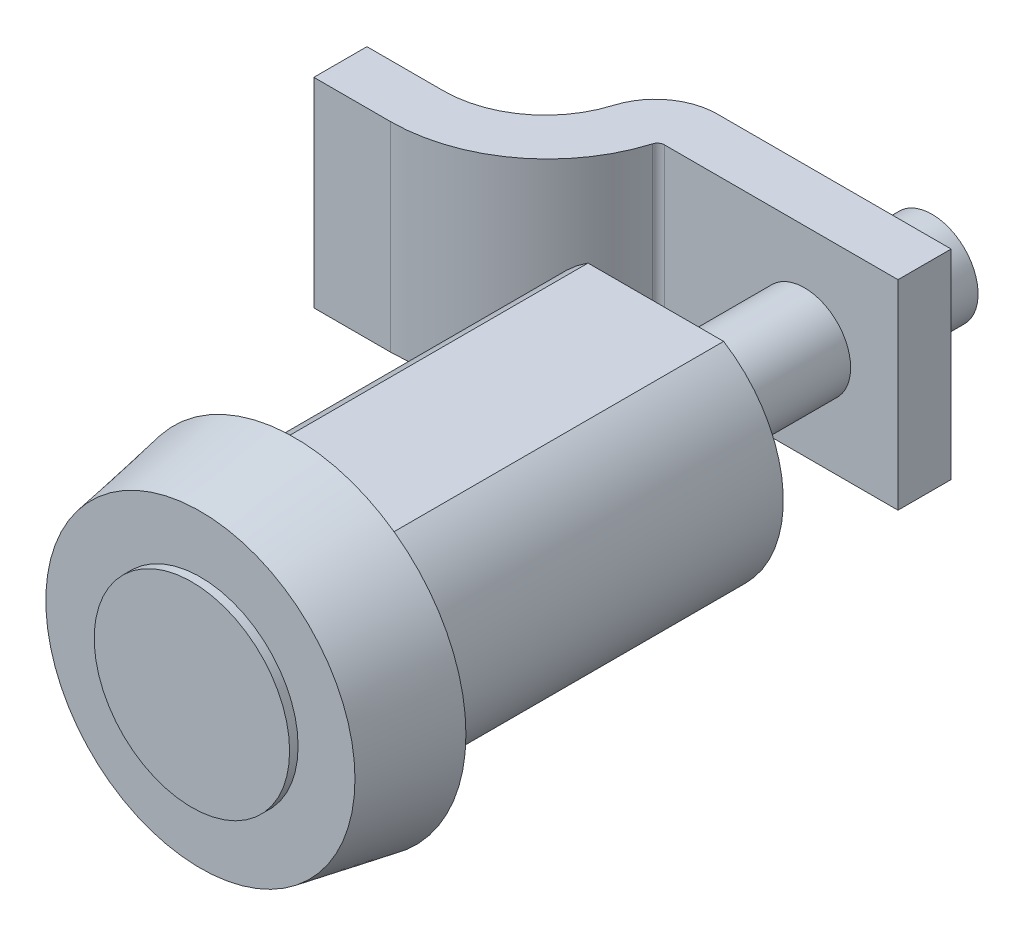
ISO-10303-21;
HEADER;
FILE_DESCRIPTION(('STEP AP214'),'2;1');
FILE_NAME('part.step','',(''),(''),'','','');
FILE_SCHEMA(('AUTOMOTIVE_DESIGN { 1 0 10303 214 1 1 1 1 }'));
ENDSEC;
DATA;
#1=APPLICATION_CONTEXT('core data for automotive mechanical design processes');
#2=APPLICATION_PROTOCOL_DEFINITION('international standard','automotive_design',2000,#1);
#3=PRODUCT_CONTEXT('',#1,'mechanical');
#4=PRODUCT('Part','Part','',(#3));
#5=PRODUCT_RELATED_PRODUCT_CATEGORY('part','',(#4));
#6=PRODUCT_DEFINITION_FORMATION('','',#4);
#7=PRODUCT_DEFINITION_CONTEXT('part definition',#1,'design');
#8=PRODUCT_DEFINITION('design','',#6,#7);
#9=PRODUCT_DEFINITION_SHAPE('','',#8);
#10=(LENGTH_UNIT() NAMED_UNIT(*) SI_UNIT(.MILLI.,.METRE.));
#11=(NAMED_UNIT(*) PLANE_ANGLE_UNIT() SI_UNIT($,.RADIAN.));
#12=(NAMED_UNIT(*) SI_UNIT($,.STERADIAN.) SOLID_ANGLE_UNIT());
#13=UNCERTAINTY_MEASURE_WITH_UNIT(LENGTH_MEASURE(1.E-05),#10,'distance_accuracy_value','');
#14=(GEOMETRIC_REPRESENTATION_CONTEXT(3) GLOBAL_UNCERTAINTY_ASSIGNED_CONTEXT((#13)) GLOBAL_UNIT_ASSIGNED_CONTEXT((#10,
#11,#12)) REPRESENTATION_CONTEXT('',''));
#15=CARTESIAN_POINT('',(0.,0.,0.));
#16=DIRECTION('',(0.,0.,1.));
#17=DIRECTION('',(1.,0.,0.));
#18=AXIS2_PLACEMENT_3D('',#15,#16,#17);
#19=CARTESIAN_POINT('',(0.,0.,0.));
#20=DIRECTION('',(0.,0.,1.));
#21=DIRECTION('',(1.,0.,0.));
#22=AXIS2_PLACEMENT_3D('',#19,#20,#21);
#23=PLANE('',#22);
#24=CARTESIAN_POINT('',(0.,0.,0.));
#25=DIRECTION('',(0.,0.,1.));
#26=DIRECTION('',(1.,0.,0.));
#27=AXIS2_PLACEMENT_3D('',#24,#25,#26);
#28=CIRCLE('',#27,10.2362);
#29=CARTESIAN_POINT('',(10.2362,0.,0.));
#30=VERTEX_POINT('',#29);
#31=EDGE_CURVE('E258',#30,#30,#28,.T.);
#32=ORIENTED_EDGE('',*,*,#31,.F.);
#33=EDGE_LOOP('',(#32));
#34=FACE_BOUND('',#33,.T.);
#35=CARTESIAN_POINT('',(0.,0.,0.));
#36=DIRECTION('',(0.,0.,-1.));
#37=DIRECTION('',(-1.,0.,0.));
#38=AXIS2_PLACEMENT_3D('',#35,#36,#37);
#39=CIRCLE('',#38,7.62);
#40=CARTESIAN_POINT('',(4.05478204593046,6.4516,0.));
#41=VERTEX_POINT('',#40);
#42=CARTESIAN_POINT('',(4.05478204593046,-6.4516,0.));
#43=VERTEX_POINT('',#42);
#44=EDGE_CURVE('E49',#41,#43,#39,.T.);
#45=ORIENTED_EDGE('',*,*,#44,.F.);
#46=DIRECTION('',(1.,0.,0.));
#47=VECTOR('',#46,1.);
#48=CARTESIAN_POINT('',(4.05478204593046,6.4516,0.));
#49=LINE('',#48,#47);
#50=CARTESIAN_POINT('',(-4.05478204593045,6.4516,0.));
#51=VERTEX_POINT('',#50);
#52=EDGE_CURVE('E53',#51,#41,#49,.T.);
#53=ORIENTED_EDGE('',*,*,#52,.F.);
#54=CARTESIAN_POINT('',(0.,0.,0.));
#55=DIRECTION('',(0.,0.,-1.));
#56=DIRECTION('',(-1.,0.,0.));
#57=AXIS2_PLACEMENT_3D('',#54,#55,#56);
#58=CIRCLE('',#57,7.62);
#59=CARTESIAN_POINT('',(-4.05478204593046,-6.4516,0.));
#60=VERTEX_POINT('',#59);
#61=EDGE_CURVE('E241',#60,#51,#58,.T.);
#62=ORIENTED_EDGE('',*,*,#61,.F.);
#63=DIRECTION('',(-1.,0.,0.));
#64=VECTOR('',#63,1.);
#65=CARTESIAN_POINT('',(4.05478204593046,-6.4516,0.));
#66=LINE('',#65,#64);
#67=EDGE_CURVE('E238',#43,#60,#66,.T.);
#68=ORIENTED_EDGE('',*,*,#67,.F.);
#69=EDGE_LOOP('',(#45,#53,#62,#68));
#70=FACE_BOUND('',#69,.T.);
#71=ADVANCED_FACE('F32',(#34,#70),#23,.F.);
#72=CARTESIAN_POINT('',(0.,0.,0.));
#73=DIRECTION('',(0.,0.,-1.));
#74=DIRECTION('',(1.,0.,0.));
#75=AXIS2_PLACEMENT_3D('',#72,#73,#74);
#76=CONICAL_SURFACE('',#75,10.2362,0.174532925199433);
#77=CARTESIAN_POINT('',(0.,0.,5.6388));
#78=DIRECTION('',(0.,0.,1.));
#79=DIRECTION('',(1.,0.,0.));
#80=AXIS2_PLACEMENT_3D('',#77,#78,#79);
#81=CIRCLE('',#80,9.24192742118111);
#82=CARTESIAN_POINT('',(9.24192742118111,0.,5.6388));
#83=VERTEX_POINT('',#82);
#84=EDGE_CURVE('E261',#83,#83,#81,.T.);
#85=ORIENTED_EDGE('',*,*,#84,.F.);
#86=EDGE_LOOP('',(#85));
#87=FACE_BOUND('',#86,.T.);
#88=ORIENTED_EDGE('',*,*,#31,.T.);
#89=EDGE_LOOP('',(#88));
#90=FACE_BOUND('',#89,.T.);
#91=ADVANCED_FACE('F34',(#87,#90),#76,.T.);
#92=CARTESIAN_POINT('',(0.,0.,5.6388));
#93=DIRECTION('',(0.,0.,1.));
#94=DIRECTION('',(1.,0.,0.));
#95=AXIS2_PLACEMENT_3D('',#92,#93,#94);
#96=PLANE('',#95);
#97=CARTESIAN_POINT('',(0.,0.,5.6388));
#98=DIRECTION('',(0.,0.,1.));
#99=DIRECTION('',(1.,0.,0.));
#100=AXIS2_PLACEMENT_3D('',#97,#98,#99);
#101=CIRCLE('',#100,5.842);
#102=CARTESIAN_POINT('',(5.842,0.,5.6388));
#103=VERTEX_POINT('',#102);
#104=EDGE_CURVE('E41',#103,#103,#101,.T.);
#105=ORIENTED_EDGE('',*,*,#104,.F.);
#106=EDGE_LOOP('',(#105));
#107=FACE_BOUND('',#106,.T.);
#108=ORIENTED_EDGE('',*,*,#84,.T.);
#109=EDGE_LOOP('',(#108));
#110=FACE_BOUND('',#109,.T.);
#111=ADVANCED_FACE('F294',(#107,#110),#96,.T.);
#112=CARTESIAN_POINT('',(0.,0.,6.1468));
#113=DIRECTION('',(0.,0.,-1.));
#114=DIRECTION('',(-1.,0.,0.));
#115=AXIS2_PLACEMENT_3D('',#112,#113,#114);
#116=CYLINDRICAL_SURFACE('',#115,5.842);
#117=CARTESIAN_POINT('',(0.,0.,6.1468));
#118=DIRECTION('',(0.,0.,1.));
#119=DIRECTION('',(1.,0.,0.));
#120=AXIS2_PLACEMENT_3D('',#117,#118,#119);
#121=CIRCLE('',#120,5.842);
#122=CARTESIAN_POINT('',(5.842,0.,6.1468));
#123=VERTEX_POINT('',#122);
#124=EDGE_CURVE('E255',#123,#123,#121,.T.);
#125=ORIENTED_EDGE('',*,*,#124,.F.);
#126=EDGE_LOOP('',(#125));
#127=FACE_BOUND('',#126,.T.);
#128=ORIENTED_EDGE('',*,*,#104,.T.);
#129=EDGE_LOOP('',(#128));
#130=FACE_BOUND('',#129,.T.);
#131=ADVANCED_FACE('F300',(#127,#130),#116,.T.);
#132=CARTESIAN_POINT('',(0.,0.,6.1468));
#133=DIRECTION('',(0.,0.,1.));
#134=DIRECTION('',(1.,0.,0.));
#135=AXIS2_PLACEMENT_3D('',#132,#133,#134);
#136=PLANE('',#135);
#137=ORIENTED_EDGE('',*,*,#124,.T.);
#138=EDGE_LOOP('',(#137));
#139=FACE_BOUND('',#138,.T.);
#140=ADVANCED_FACE('F304',(#139),#136,.T.);
#141=CARTESIAN_POINT('',(0.,0.,-21.59));
#142=DIRECTION('',(0.,0.,1.));
#143=DIRECTION('',(1.,0.,0.));
#144=AXIS2_PLACEMENT_3D('',#141,#142,#143);
#145=CYLINDRICAL_SURFACE('',#144,7.62);
#146=ORIENTED_EDGE('',*,*,#44,.T.);
#147=DIRECTION('',(0.,0.,1.));
#148=VECTOR('',#147,1.);
#149=CARTESIAN_POINT('',(4.05478204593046,-6.4516,-21.59));
#150=LINE('',#149,#148);
#151=CARTESIAN_POINT('',(4.05478204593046,-6.4516,-21.59));
#152=VERTEX_POINT('',#151);
#153=EDGE_CURVE('E252',#152,#43,#150,.T.);
#154=ORIENTED_EDGE('',*,*,#153,.F.);
#155=CARTESIAN_POINT('',(0.,0.,-21.59));
#156=DIRECTION('',(0.,0.,-1.));
#157=DIRECTION('',(-1.,0.,0.));
#158=AXIS2_PLACEMENT_3D('',#155,#156,#157);
#159=CIRCLE('',#158,7.62);
#160=CARTESIAN_POINT('',(4.05478204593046,6.4516,-21.59));
#161=VERTEX_POINT('',#160);
#162=EDGE_CURVE('E227',#161,#152,#159,.T.);
#163=ORIENTED_EDGE('',*,*,#162,.F.);
#164=DIRECTION('',(0.,0.,1.));
#165=VECTOR('',#164,1.);
#166=CARTESIAN_POINT('',(4.05478204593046,6.4516,-21.59));
#167=LINE('',#166,#165);
#168=EDGE_CURVE('E236',#161,#41,#167,.T.);
#169=ORIENTED_EDGE('',*,*,#168,.T.);
#170=EDGE_LOOP('',(#146,#154,#163,#169));
#171=FACE_BOUND('',#170,.T.);
#172=ADVANCED_FACE('F308',(#171),#145,.T.);
#173=CARTESIAN_POINT('',(4.05478204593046,-6.4516,-21.59));
#174=DIRECTION('',(0.,1.,0.));
#175=DIRECTION('',(0.,0.,1.));
#176=AXIS2_PLACEMENT_3D('',#173,#174,#175);
#177=PLANE('',#176);
#178=ORIENTED_EDGE('',*,*,#67,.T.);
#179=DIRECTION('',(0.,0.,1.));
#180=VECTOR('',#179,1.);
#181=CARTESIAN_POINT('',(-4.05478204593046,-6.4516,-21.59));
#182=LINE('',#181,#180);
#183=CARTESIAN_POINT('',(-4.05478204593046,-6.4516,-21.59));
#184=VERTEX_POINT('',#183);
#185=EDGE_CURVE('E249',#184,#60,#182,.T.);
#186=ORIENTED_EDGE('',*,*,#185,.F.);
#187=DIRECTION('',(-1.,0.,0.));
#188=VECTOR('',#187,1.);
#189=CARTESIAN_POINT('',(4.05478204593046,-6.4516,-21.59));
#190=LINE('',#189,#188);
#191=EDGE_CURVE('E230',#152,#184,#190,.T.);
#192=ORIENTED_EDGE('',*,*,#191,.F.);
#193=ORIENTED_EDGE('',*,*,#153,.T.);
#194=EDGE_LOOP('',(#178,#186,#192,#193));
#195=FACE_BOUND('',#194,.T.);
#196=ADVANCED_FACE('F312',(#195),#177,.F.);
#197=CARTESIAN_POINT('',(0.,0.,-21.59));
#198=DIRECTION('',(0.,0.,1.));
#199=DIRECTION('',(1.,0.,0.));
#200=AXIS2_PLACEMENT_3D('',#197,#198,#199);
#201=CYLINDRICAL_SURFACE('',#200,7.62);
#202=ORIENTED_EDGE('',*,*,#61,.T.);
#203=DIRECTION('',(0.,0.,1.));
#204=VECTOR('',#203,1.);
#205=CARTESIAN_POINT('',(-4.05478204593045,6.4516,-21.59));
#206=LINE('',#205,#204);
#207=CARTESIAN_POINT('',(-4.05478204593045,6.4516,-21.59));
#208=VERTEX_POINT('',#207);
#209=EDGE_CURVE('E246',#208,#51,#206,.T.);
#210=ORIENTED_EDGE('',*,*,#209,.F.);
#211=CARTESIAN_POINT('',(0.,0.,-21.59));
#212=DIRECTION('',(0.,0.,-1.));
#213=DIRECTION('',(-1.,0.,0.));
#214=AXIS2_PLACEMENT_3D('',#211,#212,#213);
#215=CIRCLE('',#214,7.62);
#216=EDGE_CURVE('E232',#184,#208,#215,.T.);
#217=ORIENTED_EDGE('',*,*,#216,.F.);
#218=ORIENTED_EDGE('',*,*,#185,.T.);
#219=EDGE_LOOP('',(#202,#210,#217,#218));
#220=FACE_BOUND('',#219,.T.);
#221=ADVANCED_FACE('F316',(#220),#201,.T.);
#222=CARTESIAN_POINT('',(4.05478204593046,6.4516,-21.59));
#223=DIRECTION('',(0.,-1.,0.));
#224=DIRECTION('',(0.,0.,-1.));
#225=AXIS2_PLACEMENT_3D('',#222,#223,#224);
#226=PLANE('',#225);
#227=ORIENTED_EDGE('',*,*,#52,.T.);
#228=ORIENTED_EDGE('',*,*,#168,.F.);
#229=DIRECTION('',(1.,0.,0.));
#230=VECTOR('',#229,1.);
#231=CARTESIAN_POINT('',(4.05478204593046,6.4516,-21.59));
#232=LINE('',#231,#230);
#233=EDGE_CURVE('E234',#208,#161,#232,.T.);
#234=ORIENTED_EDGE('',*,*,#233,.F.);
#235=ORIENTED_EDGE('',*,*,#209,.T.);
#236=EDGE_LOOP('',(#227,#228,#234,#235));
#237=FACE_BOUND('',#236,.T.);
#238=ADVANCED_FACE('F320',(#237),#226,.F.);
#239=CARTESIAN_POINT('',(0.,0.,-21.59));
#240=DIRECTION('',(0.,0.,-1.));
#241=DIRECTION('',(-1.,0.,0.));
#242=AXIS2_PLACEMENT_3D('',#239,#240,#241);
#243=PLANE('',#242);
#244=CARTESIAN_POINT('',(0.,0.,-21.59));
#245=DIRECTION('',(0.,0.,-1.));
#246=DIRECTION('',(-1.,0.,0.));
#247=AXIS2_PLACEMENT_3D('',#244,#245,#246);
#248=CIRCLE('',#247,2.7559);
#249=CARTESIAN_POINT('',(-2.7559,0.,-21.59));
#250=VERTEX_POINT('',#249);
#251=EDGE_CURVE('E11',#250,#250,#248,.T.);
#252=ORIENTED_EDGE('',*,*,#251,.F.);
#253=EDGE_LOOP('',(#252));
#254=FACE_BOUND('',#253,.T.);
#255=ORIENTED_EDGE('',*,*,#162,.T.);
#256=ORIENTED_EDGE('',*,*,#191,.T.);
#257=ORIENTED_EDGE('',*,*,#216,.T.);
#258=ORIENTED_EDGE('',*,*,#233,.T.);
#259=EDGE_LOOP('',(#255,#256,#257,#258));
#260=FACE_BOUND('',#259,.T.);
#261=ADVANCED_FACE('F285',(#254,#260),#243,.T.);
#262=CARTESIAN_POINT('',(0.,0.,-38.1));
#263=DIRECTION('',(0.,0.,1.));
#264=DIRECTION('',(1.,0.,0.));
#265=AXIS2_PLACEMENT_3D('',#262,#263,#264);
#266=CYLINDRICAL_SURFACE('',#265,2.7559);
#267=CARTESIAN_POINT('',(0.,0.,-30.48));
#268=DIRECTION('',(0.,0.,1.));
#269=DIRECTION('',(1.,0.,0.));
#270=AXIS2_PLACEMENT_3D('',#267,#268,#269);
#271=CIRCLE('',#270,2.7559);
#272=CARTESIAN_POINT('',(2.7559,0.,-30.48));
#273=VERTEX_POINT('',#272);
#274=EDGE_CURVE('E208',#273,#273,#271,.T.);
#275=ORIENTED_EDGE('',*,*,#274,.T.);
#276=EDGE_LOOP('',(#275));
#277=FACE_BOUND('',#276,.T.);
#278=ORIENTED_EDGE('',*,*,#251,.T.);
#279=EDGE_LOOP('',(#278));
#280=FACE_BOUND('',#279,.T.);
#281=ADVANCED_FACE('F276',(#277,#280),#266,.T.);
#282=CARTESIAN_POINT('',(-8.382,-5.969,-33.655));
#283=DIRECTION('',(0.,0.,-1.));
#284=DIRECTION('',(-1.,0.,0.));
#285=AXIS2_PLACEMENT_3D('',#282,#283,#284);
#286=PLANE('',#285);
#287=CARTESIAN_POINT('',(0.,0.,-33.655));
#288=DIRECTION('',(0.,0.,-1.));
#289=DIRECTION('',(-1.,0.,0.));
#290=AXIS2_PLACEMENT_3D('',#287,#288,#289);
#291=CIRCLE('',#290,2.7559);
#292=CARTESIAN_POINT('',(-2.7559,0.,-33.655));
#293=VERTEX_POINT('',#292);
#294=EDGE_CURVE('E36',#293,#293,#291,.T.);
#295=ORIENTED_EDGE('',*,*,#294,.F.);
#296=EDGE_LOOP('',(#295));
#297=FACE_BOUND('',#296,.T.);
#298=DIRECTION('',(0.,1.,0.));
#299=VECTOR('',#298,1.);
#300=CARTESIAN_POINT('',(-8.382,-5.969,-33.655));
#301=LINE('',#300,#299);
#302=CARTESIAN_POINT('',(-8.382,-5.969,-33.655));
#303=VERTEX_POINT('',#302);
#304=CARTESIAN_POINT('',(-8.382,5.969,-33.655));
#305=VERTEX_POINT('',#304);
#306=EDGE_CURVE('E133',#303,#305,#301,.T.);
#307=ORIENTED_EDGE('',*,*,#306,.T.);
#308=DIRECTION('',(-1.,0.,0.));
#309=VECTOR('',#308,1.);
#310=CARTESIAN_POINT('',(-8.382,5.969,-33.655));
#311=LINE('',#310,#309);
#312=CARTESIAN_POINT('',(5.588,5.969,-33.655));
#313=VERTEX_POINT('',#312);
#314=EDGE_CURVE('E137',#313,#305,#311,.T.);
#315=ORIENTED_EDGE('',*,*,#314,.F.);
#316=DIRECTION('',(0.,1.,0.));
#317=VECTOR('',#316,1.);
#318=CARTESIAN_POINT('',(5.588,-5.969,-33.655));
#319=LINE('',#318,#317);
#320=CARTESIAN_POINT('',(5.588,-5.969,-33.655));
#321=VERTEX_POINT('',#320);
#322=EDGE_CURVE('E206',#321,#313,#319,.T.);
#323=ORIENTED_EDGE('',*,*,#322,.F.);
#324=DIRECTION('',(-1.,0.,0.));
#325=VECTOR('',#324,1.);
#326=CARTESIAN_POINT('',(-8.382,-5.969,-33.655));
#327=LINE('',#326,#325);
#328=EDGE_CURVE('E139',#321,#303,#327,.T.);
#329=ORIENTED_EDGE('',*,*,#328,.T.);
#330=EDGE_LOOP('',(#307,#315,#323,#329));
#331=FACE_BOUND('',#330,.T.);
#332=ADVANCED_FACE('F135',(#297,#331),#286,.T.);
#333=CARTESIAN_POINT('',(5.588,-5.969,-33.655));
#334=DIRECTION('',(1.,0.,0.));
#335=DIRECTION('',(0.,0.,-1.));
#336=AXIS2_PLACEMENT_3D('',#333,#334,#335);
#337=PLANE('',#336);
#338=ORIENTED_EDGE('',*,*,#322,.T.);
#339=DIRECTION('',(0.,0.,-1.));
#340=VECTOR('',#339,1.);
#341=CARTESIAN_POINT('',(5.588,5.969,-33.655));
#342=LINE('',#341,#340);
#343=CARTESIAN_POINT('',(5.588,5.969,-30.48));
#344=VERTEX_POINT('',#343);
#345=EDGE_CURVE('E158',#344,#313,#342,.T.);
#346=ORIENTED_EDGE('',*,*,#345,.F.);
#347=DIRECTION('',(0.,1.,0.));
#348=VECTOR('',#347,1.);
#349=CARTESIAN_POINT('',(5.588,-5.969,-30.48));
#350=LINE('',#349,#348);
#351=CARTESIAN_POINT('',(5.588,-5.969,-30.48));
#352=VERTEX_POINT('',#351);
#353=EDGE_CURVE('E209',#352,#344,#350,.T.);
#354=ORIENTED_EDGE('',*,*,#353,.F.);
#355=DIRECTION('',(0.,0.,-1.));
#356=VECTOR('',#355,1.);
#357=CARTESIAN_POINT('',(5.588,-5.969,-33.655));
#358=LINE('',#357,#356);
#359=EDGE_CURVE('E144',#352,#321,#358,.T.);
#360=ORIENTED_EDGE('',*,*,#359,.T.);
#361=EDGE_LOOP('',(#338,#346,#354,#360));
#362=FACE_BOUND('',#361,.T.);
#363=ADVANCED_FACE('F275',(#362),#337,.T.);
#364=CARTESIAN_POINT('',(5.588,-5.969,-30.48));
#365=DIRECTION('',(0.,0.,1.));
#366=DIRECTION('',(1.,0.,0.));
#367=AXIS2_PLACEMENT_3D('',#364,#365,#366);
#368=PLANE('',#367);
#369=ORIENTED_EDGE('',*,*,#274,.F.);
#370=EDGE_LOOP('',(#369));
#371=FACE_BOUND('',#370,.T.);
#372=ORIENTED_EDGE('',*,*,#353,.T.);
#373=DIRECTION('',(1.,0.,0.));
#374=VECTOR('',#373,1.);
#375=CARTESIAN_POINT('',(5.588,5.969,-30.48));
#376=LINE('',#375,#374);
#377=CARTESIAN_POINT('',(-8.382,5.969,-30.48));
#378=VERTEX_POINT('',#377);
#379=EDGE_CURVE('E177',#378,#344,#376,.T.);
#380=ORIENTED_EDGE('',*,*,#379,.F.);
#381=DIRECTION('',(0.,1.,0.));
#382=VECTOR('',#381,1.);
#383=CARTESIAN_POINT('',(-8.382,-5.969,-30.48));
#384=LINE('',#383,#382);
#385=CARTESIAN_POINT('',(-8.382,-5.969,-30.48));
#386=VERTEX_POINT('',#385);
#387=EDGE_CURVE('E211',#386,#378,#384,.T.);
#388=ORIENTED_EDGE('',*,*,#387,.F.);
#389=DIRECTION('',(1.,0.,0.));
#390=VECTOR('',#389,1.);
#391=CARTESIAN_POINT('',(5.588,-5.969,-30.48));
#392=LINE('',#391,#390);
#393=EDGE_CURVE('E201',#386,#352,#392,.T.);
#394=ORIENTED_EDGE('',*,*,#393,.T.);
#395=EDGE_LOOP('',(#372,#380,#388,#394));
#396=FACE_BOUND('',#395,.T.);
#397=ADVANCED_FACE('F282',(#371,#396),#368,.T.);
#398=CARTESIAN_POINT('',(-8.382,-5.969,-30.0632090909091));
#399=DIRECTION('',(0.,1.,0.));
#400=DIRECTION('',(0.,0.,1.));
#401=AXIS2_PLACEMENT_3D('',#398,#399,#400);
#402=CYLINDRICAL_SURFACE('',#401,0.416790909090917);
#403=ORIENTED_EDGE('',*,*,#387,.T.);
#404=CARTESIAN_POINT('',(-8.382,5.969,-30.0632090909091));
#405=DIRECTION('',(0.,-1.,0.));
#406=DIRECTION('',(0.,0.,1.));
#407=AXIS2_PLACEMENT_3D('',#404,#405,#406);
#408=CIRCLE('',#407,0.416790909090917);
#409=CARTESIAN_POINT('',(-8.78109163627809,5.969,-30.1833778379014));
#410=VERTEX_POINT('',#409);
#411=EDGE_CURVE('E174',#410,#378,#408,.T.);
#412=ORIENTED_EDGE('',*,*,#411,.F.);
#413=DIRECTION('',(0.,1.,0.));
#414=VECTOR('',#413,1.);
#415=CARTESIAN_POINT('',(-8.78109163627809,-5.969,-30.1833778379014));
#416=LINE('',#415,#414);
#417=CARTESIAN_POINT('',(-8.78109163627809,-5.969,-30.1833778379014));
#418=VERTEX_POINT('',#417);
#419=EDGE_CURVE('E213',#418,#410,#416,.T.);
#420=ORIENTED_EDGE('',*,*,#419,.F.);
#421=CARTESIAN_POINT('',(-8.382,-5.969,-30.0632090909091));
#422=DIRECTION('',(0.,-1.,0.));
#423=DIRECTION('',(0.,0.,1.));
#424=AXIS2_PLACEMENT_3D('',#421,#422,#423);
#425=CIRCLE('',#424,0.416790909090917);
#426=EDGE_CURVE('E198',#418,#386,#425,.T.);
#427=ORIENTED_EDGE('',*,*,#426,.T.);
#428=EDGE_LOOP('',(#403,#412,#420,#427));
#429=FACE_BOUND('',#428,.T.);
#430=ADVANCED_FACE('F345',(#429),#402,.F.);
#431=CARTESIAN_POINT('',(-17.78,-5.969,-32.893));
#432=DIRECTION('',(0.,1.,0.));
#433=DIRECTION('',(0.,0.,1.));
#434=AXIS2_PLACEMENT_3D('',#431,#432,#433);
#435=CYLINDRICAL_SURFACE('',#434,9.398);
#436=ORIENTED_EDGE('',*,*,#419,.T.);
#437=CARTESIAN_POINT('',(-17.78,5.969,-32.893));
#438=DIRECTION('',(0.,1.,0.));
#439=DIRECTION('',(0.,0.,-1.));
#440=AXIS2_PLACEMENT_3D('',#437,#438,#439);
#441=CIRCLE('',#440,9.398);
#442=CARTESIAN_POINT('',(-17.78,5.969,-23.495));
#443=VERTEX_POINT('',#442);
#444=EDGE_CURVE('E171',#443,#410,#441,.T.);
#445=ORIENTED_EDGE('',*,*,#444,.F.);
#446=DIRECTION('',(0.,1.,0.));
#447=VECTOR('',#446,1.);
#448=CARTESIAN_POINT('',(-17.78,-5.969,-23.495));
#449=LINE('',#448,#447);
#450=CARTESIAN_POINT('',(-17.78,-5.969,-23.495));
#451=VERTEX_POINT('',#450);
#452=EDGE_CURVE('E215',#451,#443,#449,.T.);
#453=ORIENTED_EDGE('',*,*,#452,.F.);
#454=CARTESIAN_POINT('',(-17.78,-5.969,-32.893));
#455=DIRECTION('',(0.,1.,0.));
#456=DIRECTION('',(0.,0.,-1.));
#457=AXIS2_PLACEMENT_3D('',#454,#455,#456);
#458=CIRCLE('',#457,9.398);
#459=EDGE_CURVE('E195',#451,#418,#458,.T.);
#460=ORIENTED_EDGE('',*,*,#459,.T.);
#461=EDGE_LOOP('',(#436,#445,#453,#460));
#462=FACE_BOUND('',#461,.T.);
#463=ADVANCED_FACE('F349',(#462),#435,.T.);
#464=CARTESIAN_POINT('',(-17.78,-5.969,-23.495));
#465=DIRECTION('',(0.,0.,1.));
#466=DIRECTION('',(1.,0.,0.));
#467=AXIS2_PLACEMENT_3D('',#464,#465,#466);
#468=PLANE('',#467);
#469=ORIENTED_EDGE('',*,*,#452,.T.);
#470=DIRECTION('',(1.,0.,0.));
#471=VECTOR('',#470,1.);
#472=CARTESIAN_POINT('',(-17.78,5.969,-23.495));
#473=LINE('',#472,#471);
#474=CARTESIAN_POINT('',(-22.352,5.969,-23.495));
#475=VERTEX_POINT('',#474);
#476=EDGE_CURVE('E168',#475,#443,#473,.T.);
#477=ORIENTED_EDGE('',*,*,#476,.F.);
#478=DIRECTION('',(0.,1.,0.));
#479=VECTOR('',#478,1.);
#480=CARTESIAN_POINT('',(-22.352,-5.969,-23.495));
#481=LINE('',#480,#479);
#482=CARTESIAN_POINT('',(-22.352,-5.969,-23.495));
#483=VERTEX_POINT('',#482);
#484=EDGE_CURVE('E217',#483,#475,#481,.T.);
#485=ORIENTED_EDGE('',*,*,#484,.F.);
#486=DIRECTION('',(1.,0.,0.));
#487=VECTOR('',#486,1.);
#488=CARTESIAN_POINT('',(-17.78,-5.969,-23.495));
#489=LINE('',#488,#487);
#490=EDGE_CURVE('E192',#483,#451,#489,.T.);
#491=ORIENTED_EDGE('',*,*,#490,.T.);
#492=EDGE_LOOP('',(#469,#477,#485,#491));
#493=FACE_BOUND('',#492,.T.);
#494=ADVANCED_FACE('F353',(#493),#468,.T.);
#495=CARTESIAN_POINT('',(-22.352,-5.969,-23.495));
#496=DIRECTION('',(-1.,0.,0.));
#497=DIRECTION('',(0.,0.,1.));
#498=AXIS2_PLACEMENT_3D('',#495,#496,#497);
#499=PLANE('',#498);
#500=ORIENTED_EDGE('',*,*,#484,.T.);
#501=DIRECTION('',(0.,0.,1.));
#502=VECTOR('',#501,1.);
#503=CARTESIAN_POINT('',(-22.352,5.969,-23.495));
#504=LINE('',#503,#502);
#505=CARTESIAN_POINT('',(-22.352,5.969,-26.67));
#506=VERTEX_POINT('',#505);
#507=EDGE_CURVE('E165',#506,#475,#504,.T.);
#508=ORIENTED_EDGE('',*,*,#507,.F.);
#509=DIRECTION('',(0.,1.,0.));
#510=VECTOR('',#509,1.);
#511=CARTESIAN_POINT('',(-22.352,-5.969,-26.67));
#512=LINE('',#511,#510);
#513=CARTESIAN_POINT('',(-22.352,-5.969,-26.67));
#514=VERTEX_POINT('',#513);
#515=EDGE_CURVE('E219',#514,#506,#512,.T.);
#516=ORIENTED_EDGE('',*,*,#515,.F.);
#517=DIRECTION('',(0.,0.,1.));
#518=VECTOR('',#517,1.);
#519=CARTESIAN_POINT('',(-22.352,-5.969,-23.495));
#520=LINE('',#519,#518);
#521=EDGE_CURVE('E189',#514,#483,#520,.T.);
#522=ORIENTED_EDGE('',*,*,#521,.T.);
#523=EDGE_LOOP('',(#500,#508,#516,#522));
#524=FACE_BOUND('',#523,.T.);
#525=ADVANCED_FACE('F357',(#524),#499,.T.);
#526=CARTESIAN_POINT('',(-22.352,-5.969,-26.67));
#527=DIRECTION('',(0.,0.,-1.));
#528=DIRECTION('',(-1.,0.,0.));
#529=AXIS2_PLACEMENT_3D('',#526,#527,#528);
#530=PLANE('',#529);
#531=ORIENTED_EDGE('',*,*,#515,.T.);
#532=DIRECTION('',(-1.,0.,0.));
#533=VECTOR('',#532,1.);
#534=CARTESIAN_POINT('',(-22.352,5.969,-26.67));
#535=LINE('',#534,#533);
#536=CARTESIAN_POINT('',(-17.78,5.969,-26.67));
#537=VERTEX_POINT('',#536);
#538=EDGE_CURVE('E162',#537,#506,#535,.T.);
#539=ORIENTED_EDGE('',*,*,#538,.F.);
#540=DIRECTION('',(0.,1.,0.));
#541=VECTOR('',#540,1.);
#542=CARTESIAN_POINT('',(-17.78,-5.969,-26.67));
#543=LINE('',#542,#541);
#544=CARTESIAN_POINT('',(-17.78,-5.969,-26.67));
#545=VERTEX_POINT('',#544);
#546=EDGE_CURVE('E221',#545,#537,#543,.T.);
#547=ORIENTED_EDGE('',*,*,#546,.F.);
#548=DIRECTION('',(-1.,0.,0.));
#549=VECTOR('',#548,1.);
#550=CARTESIAN_POINT('',(-22.352,-5.969,-26.67));
#551=LINE('',#550,#549);
#552=EDGE_CURVE('E186',#545,#514,#551,.T.);
#553=ORIENTED_EDGE('',*,*,#552,.T.);
#554=EDGE_LOOP('',(#531,#539,#547,#553));
#555=FACE_BOUND('',#554,.T.);
#556=ADVANCED_FACE('F361',(#555),#530,.T.);
#557=CARTESIAN_POINT('',(-17.78,-5.969,-32.766));
#558=DIRECTION('',(0.,1.,0.));
#559=DIRECTION('',(0.,0.,1.));
#560=AXIS2_PLACEMENT_3D('',#557,#558,#559);
#561=CYLINDRICAL_SURFACE('',#560,6.096);
#562=ORIENTED_EDGE('',*,*,#546,.T.);
#563=CARTESIAN_POINT('',(-17.78,5.969,-32.766));
#564=DIRECTION('',(0.,-1.,0.));
#565=DIRECTION('',(0.,0.,1.));
#566=AXIS2_PLACEMENT_3D('',#563,#564,#565);
#567=CIRCLE('',#566,6.096);
#568=CARTESIAN_POINT('',(-11.9428702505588,5.969,-31.0084072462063));
#569=VERTEX_POINT('',#568);
#570=EDGE_CURVE('E152',#569,#537,#567,.T.);
#571=ORIENTED_EDGE('',*,*,#570,.F.);
#572=DIRECTION('',(0.,1.,0.));
#573=VECTOR('',#572,1.);
#574=CARTESIAN_POINT('',(-11.9428702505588,-5.969,-31.0084072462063));
#575=LINE('',#574,#573);
#576=CARTESIAN_POINT('',(-11.9428702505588,-5.969,-31.0084072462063));
#577=VERTEX_POINT('',#576);
#578=EDGE_CURVE('E143',#577,#569,#575,.T.);
#579=ORIENTED_EDGE('',*,*,#578,.F.);
#580=CARTESIAN_POINT('',(-17.78,-5.969,-32.766));
#581=DIRECTION('',(0.,-1.,0.));
#582=DIRECTION('',(0.,0.,1.));
#583=AXIS2_PLACEMENT_3D('',#580,#581,#582);
#584=CIRCLE('',#583,6.096);
#585=EDGE_CURVE('E183',#577,#545,#584,.T.);
#586=ORIENTED_EDGE('',*,*,#585,.T.);
#587=EDGE_LOOP('',(#562,#571,#579,#586));
#588=FACE_BOUND('',#587,.T.);
#589=ADVANCED_FACE('F365',(#588),#561,.F.);
#590=CARTESIAN_POINT('',(-8.382,-5.969,-29.9362090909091));
#591=DIRECTION('',(0.,1.,0.));
#592=DIRECTION('',(0.,0.,1.));
#593=AXIS2_PLACEMENT_3D('',#590,#591,#592);
#594=CYLINDRICAL_SURFACE('',#593,3.71879090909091);
#595=ORIENTED_EDGE('',*,*,#578,.T.);
#596=CARTESIAN_POINT('',(-8.382,5.969,-29.9362090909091));
#597=DIRECTION('',(0.,1.,0.));
#598=DIRECTION('',(0.,0.,-1.));
#599=AXIS2_PLACEMENT_3D('',#596,#597,#598);
#600=CIRCLE('',#599,3.71879090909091);
#601=EDGE_CURVE('E147',#305,#569,#600,.T.);
#602=ORIENTED_EDGE('',*,*,#601,.F.);
#603=ORIENTED_EDGE('',*,*,#306,.F.);
#604=CARTESIAN_POINT('',(-8.382,-5.969,-29.9362090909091));
#605=DIRECTION('',(0.,1.,0.));
#606=DIRECTION('',(0.,0.,-1.));
#607=AXIS2_PLACEMENT_3D('',#604,#605,#606);
#608=CIRCLE('',#607,3.71879090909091);
#609=EDGE_CURVE('E181',#303,#577,#608,.T.);
#610=ORIENTED_EDGE('',*,*,#609,.T.);
#611=EDGE_LOOP('',(#595,#602,#603,#610));
#612=FACE_BOUND('',#611,.T.);
#613=ADVANCED_FACE('F148',(#612),#594,.T.);
#614=CARTESIAN_POINT('',(-8.382,-5.969,-30.0632090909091));
#615=DIRECTION('',(0.,1.,0.));
#616=DIRECTION('',(0.,0.,1.));
#617=AXIS2_PLACEMENT_3D('',#614,#615,#616);
#618=PLANE('',#617);
#619=ORIENTED_EDGE('',*,*,#328,.F.);
#620=ORIENTED_EDGE('',*,*,#359,.F.);
#621=ORIENTED_EDGE('',*,*,#393,.F.);
#622=ORIENTED_EDGE('',*,*,#426,.F.);
#623=ORIENTED_EDGE('',*,*,#459,.F.);
#624=ORIENTED_EDGE('',*,*,#490,.F.);
#625=ORIENTED_EDGE('',*,*,#521,.F.);
#626=ORIENTED_EDGE('',*,*,#552,.F.);
#627=ORIENTED_EDGE('',*,*,#585,.F.);
#628=ORIENTED_EDGE('',*,*,#609,.F.);
#629=EDGE_LOOP('',(#619,#620,#621,#622,#623,#624,#625,#626,#627,#628));
#630=FACE_BOUND('',#629,.T.);
#631=ADVANCED_FACE('F334',(#630),#618,.F.);
#632=CARTESIAN_POINT('',(-8.382,5.969,-30.0632090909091));
#633=DIRECTION('',(0.,1.,0.));
#634=DIRECTION('',(0.,0.,1.));
#635=AXIS2_PLACEMENT_3D('',#632,#633,#634);
#636=PLANE('',#635);
#637=ORIENTED_EDGE('',*,*,#314,.T.);
#638=ORIENTED_EDGE('',*,*,#601,.T.);
#639=ORIENTED_EDGE('',*,*,#570,.T.);
#640=ORIENTED_EDGE('',*,*,#538,.T.);
#641=ORIENTED_EDGE('',*,*,#507,.T.);
#642=ORIENTED_EDGE('',*,*,#476,.T.);
#643=ORIENTED_EDGE('',*,*,#444,.T.);
#644=ORIENTED_EDGE('',*,*,#411,.T.);
#645=ORIENTED_EDGE('',*,*,#379,.T.);
#646=ORIENTED_EDGE('',*,*,#345,.T.);
#647=EDGE_LOOP('',(#637,#638,#639,#640,#641,#642,#643,#644,#645,#646));
#648=FACE_BOUND('',#647,.T.);
#649=ADVANCED_FACE('F155',(#648),#636,.T.);
#650=CARTESIAN_POINT('',(0.,0.,-38.1));
#651=DIRECTION('',(0.,0.,-1.));
#652=DIRECTION('',(-1.,0.,0.));
#653=AXIS2_PLACEMENT_3D('',#650,#651,#652);
#654=PLANE('',#653);
#655=CARTESIAN_POINT('',(0.,0.,-38.1));
#656=DIRECTION('',(0.,0.,-1.));
#657=DIRECTION('',(-1.,0.,0.));
#658=AXIS2_PLACEMENT_3D('',#655,#656,#657);
#659=CIRCLE('',#658,2.7559);
#660=CARTESIAN_POINT('',(-2.7559,0.,-38.1));
#661=VERTEX_POINT('',#660);
#662=EDGE_CURVE('E224',#661,#661,#659,.T.);
#663=ORIENTED_EDGE('',*,*,#662,.T.);
#664=EDGE_LOOP('',(#663));
#665=FACE_BOUND('',#664,.T.);
#666=ADVANCED_FACE('F327',(#665),#654,.T.);
#667=ORIENTED_EDGE('',*,*,#294,.T.);
#668=EDGE_LOOP('',(#667));
#669=FACE_BOUND('',#668,.T.);
#670=ORIENTED_EDGE('',*,*,#662,.F.);
#671=EDGE_LOOP('',(#670));
#672=FACE_BOUND('',#671,.T.);
#673=ADVANCED_FACE('F271',(#669,#672),#266,.T.);
#674=CLOSED_SHELL('',(#71,#91,#111,#131,#140,#172,#196,#221,#238,#261,#281,#332,#363,#397,#430,
#463,#494,#525,#556,#589,#613,#631,#649,#666,#673));
#675=MANIFOLD_SOLID_BREP('B2',#674);
#676=ADVANCED_BREP_SHAPE_REPRESENTATION('',(#18,#675),#14);
#677=SHAPE_DEFINITION_REPRESENTATION(#9,#676);
ENDSEC;
END-ISO-10303-21;
